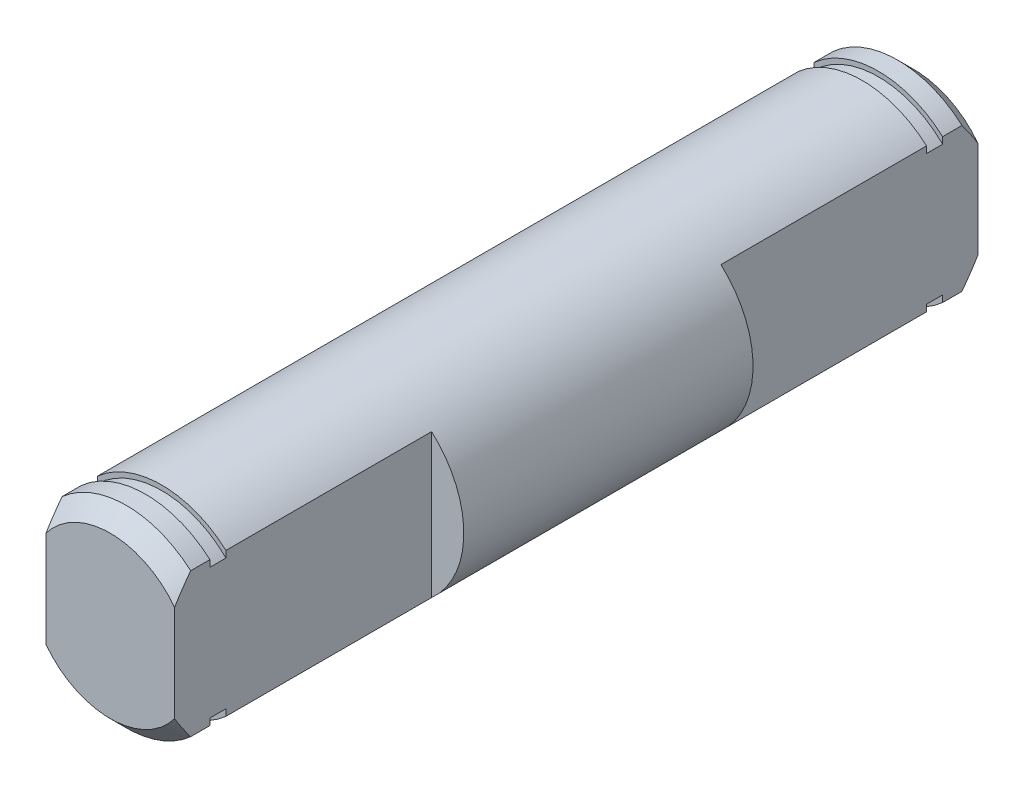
from build123d import *

# Parameters (mm, degrees)
ESQUISSE1_R             = 3
EXTRUSION1_DEPTH        = 12.5
CHANFREIN1_SIZE         = 0.5
ESQUISSE2_W             = 0.801321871
ESQUISSE2_H             = 0.5
ESQUISSE3_OUTSIDE_W     = 11.022
ESQUISSE3_OUTSIDE_H     = 11.022
ESQUISSE3_OUTSIDE_W_2   = 4
ESQUISSE3_OUTSIDE_H_2   = 6.522462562
ENL_V_MAT_EXTRU_1_DEPTH = 8


with BuildPart() as part:
    # Esquisse1 → Extrusion1 (new body)
    with BuildSketch(Plane.XY):
        Circle(ESQUISSE1_R)
    extrude(amount=EXTRUSION1_DEPTH)

    # Chanfrein1
    chanfrein1_edges = [part.edges().sort_by_distance(p)[0] for p in [
        (-3, 0, 12.5),
    ]]
    chamfer(chanfrein1_edges, length=CHANFREIN1_SIZE)

    # Esquisse2 → Enl_vement de mati_re-R_volution1 (revolve, cut)
    with BuildSketch(Plane(origin=(0, 0, 0), x_dir=(1, 0, 0), z_dir=(0, 1, 0)), mode=Mode.PRIVATE) as enl_vement_de_mati_re_r_volution1_sk:
        with Locations((3.250660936, -11.15)):
            Rectangle(ESQUISSE2_W, ESQUISSE2_H)
    revolve(enl_vement_de_mati_re_r_volution1_sk.sketch.rotate(Axis((0, 0, 0), (0, 0, 1)), 180), axis=Axis((0, 0, 0), (0, 0, 1)), mode=Mode.SUBTRACT)

    # Esquisse3 outside → Enl_v. mat.-Extru.1 (cut)
    with BuildSketch(Plane.XY.offset(12.5)):
        Rectangle(ESQUISSE3_OUTSIDE_W, ESQUISSE3_OUTSIDE_H)
        with Locations((0, 0.038824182)):
            Rectangle(ESQUISSE3_OUTSIDE_W_2, ESQUISSE3_OUTSIDE_H_2, mode=Mode.SUBTRACT)
    extrude(amount=-ENL_V_MAT_EXTRU_1_DEPTH, mode=Mode.SUBTRACT)

    # Sym_trie1: part across plane


with BuildPart() as part_1:
    add(part.part)
    add(part.part.mirror(Plane.XY))


solid = part_1.part
